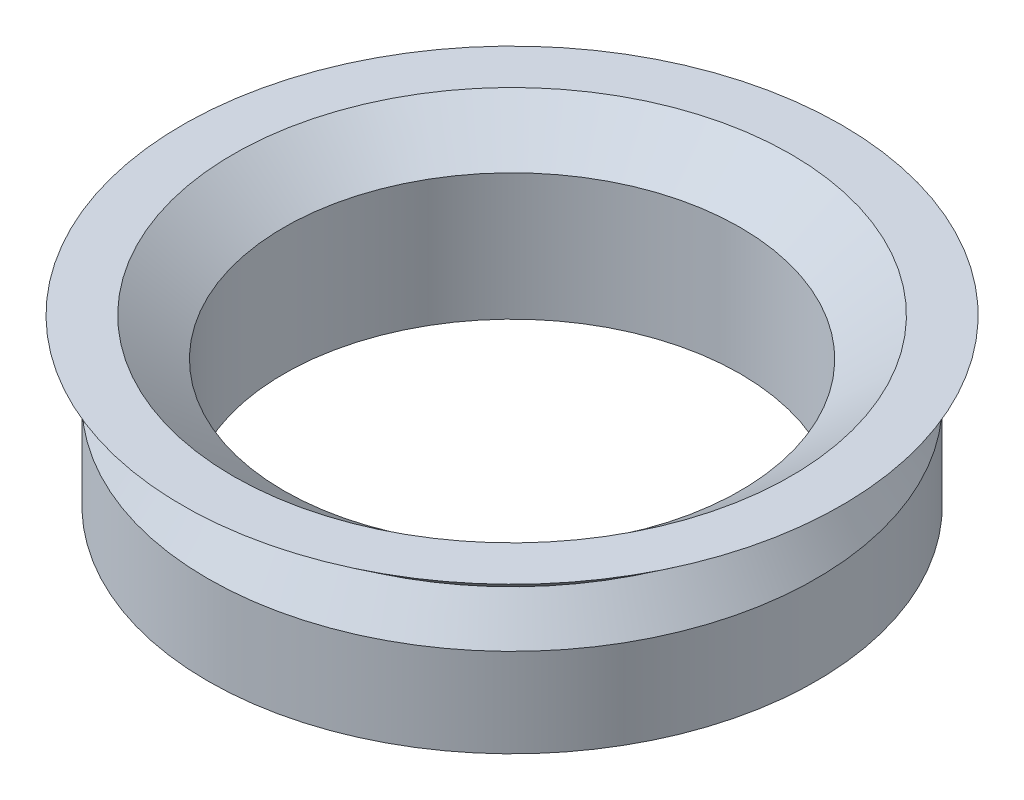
from build123d import *


with BuildPart() as part:
    # Esquisse1 → R_volution1 (revolve)
    with BuildSketch(Plane.XY, mode=Mode.PRIVATE) as r_volution1_sk:
        Polygon((9, 5), (9, 0), (12, 0), (12, 3.5), (11, 5), (13, 6.5), (11, 6.5), align=None)
    revolve(r_volution1_sk.sketch.rotate(Axis((0, -24.248861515, 0), (0, 1, 0)), 90), axis=Axis((0, -24.248861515, 0), (0, 1, 0)))


solid = part.part
